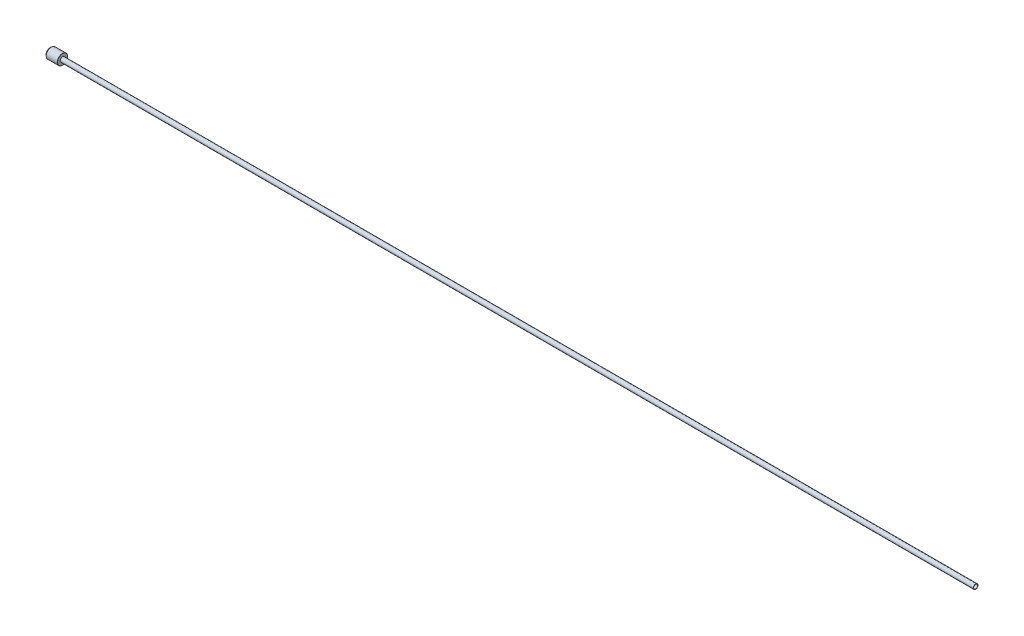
ISO-10303-21;
HEADER;
FILE_DESCRIPTION(('STEP AP214'),'2;1');
FILE_NAME('part.step','',(''),(''),'','','');
FILE_SCHEMA(('AUTOMOTIVE_DESIGN { 1 0 10303 214 1 1 1 1 }'));
ENDSEC;
DATA;
#1=APPLICATION_CONTEXT('core data for automotive mechanical design processes');
#2=APPLICATION_PROTOCOL_DEFINITION('international standard','automotive_design',2000,#1);
#3=PRODUCT_CONTEXT('',#1,'mechanical');
#4=PRODUCT('Part','Part','',(#3));
#5=PRODUCT_RELATED_PRODUCT_CATEGORY('part','',(#4));
#6=PRODUCT_DEFINITION_FORMATION('','',#4);
#7=PRODUCT_DEFINITION_CONTEXT('part definition',#1,'design');
#8=PRODUCT_DEFINITION('design','',#6,#7);
#9=PRODUCT_DEFINITION_SHAPE('','',#8);
#10=(LENGTH_UNIT() NAMED_UNIT(*) SI_UNIT(.MILLI.,.METRE.));
#11=(NAMED_UNIT(*) PLANE_ANGLE_UNIT() SI_UNIT($,.RADIAN.));
#12=(NAMED_UNIT(*) SI_UNIT($,.STERADIAN.) SOLID_ANGLE_UNIT());
#13=UNCERTAINTY_MEASURE_WITH_UNIT(LENGTH_MEASURE(1.E-05),#10,'distance_accuracy_value','');
#14=(GEOMETRIC_REPRESENTATION_CONTEXT(3) GLOBAL_UNCERTAINTY_ASSIGNED_CONTEXT((#13)) GLOBAL_UNIT_ASSIGNED_CONTEXT((#10,
#11,#12)) REPRESENTATION_CONTEXT('',''));
#15=CARTESIAN_POINT('',(0.,0.,0.));
#16=DIRECTION('',(0.,0.,1.));
#17=DIRECTION('',(1.,0.,0.));
#18=AXIS2_PLACEMENT_3D('',#15,#16,#17);
#19=CARTESIAN_POINT('',(6.,2.5,0.));
#20=DIRECTION('',(-1.,0.,0.));
#21=DIRECTION('',(0.,0.,1.));
#22=AXIS2_PLACEMENT_3D('',#19,#20,#21);
#23=PLANE('',#22);
#24=CARTESIAN_POINT('',(6.,0.,0.));
#25=DIRECTION('',(-1.,0.,0.));
#26=DIRECTION('',(0.,0.,1.));
#27=AXIS2_PLACEMENT_3D('',#24,#25,#26);
#28=CIRCLE('',#27,2.4);
#29=CARTESIAN_POINT('',(6.,0.,2.4));
#30=VERTEX_POINT('',#29);
#31=EDGE_CURVE('E10',#30,#30,#28,.F.);
#32=ORIENTED_EDGE('',*,*,#31,.T.);
#33=EDGE_LOOP('',(#32));
#34=FACE_BOUND('',#33,.T.);
#35=CARTESIAN_POINT('',(6.,0.,0.));
#36=DIRECTION('',(-1.,0.,0.));
#37=DIRECTION('',(0.,0.,1.));
#38=AXIS2_PLACEMENT_3D('',#35,#36,#37);
#39=CIRCLE('',#38,1.143);
#40=CARTESIAN_POINT('',(6.,0.,1.143));
#41=VERTEX_POINT('',#40);
#42=EDGE_CURVE('E62',#41,#41,#39,.T.);
#43=ORIENTED_EDGE('',*,*,#42,.T.);
#44=EDGE_LOOP('',(#43));
#45=FACE_BOUND('',#44,.T.);
#46=ADVANCED_FACE('F30',(#34,#45),#23,.F.);
#47=CARTESIAN_POINT('',(-22.2121854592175,0.,0.));
#48=DIRECTION('',(-1.,0.,0.));
#49=DIRECTION('',(0.,0.,1.));
#50=AXIS2_PLACEMENT_3D('',#47,#48,#49);
#51=CYLINDRICAL_SURFACE('',#50,2.5);
#52=CARTESIAN_POINT('',(5.9,0.,0.));
#53=DIRECTION('',(-1.,0.,0.));
#54=DIRECTION('',(0.,0.,1.));
#55=AXIS2_PLACEMENT_3D('',#52,#53,#54);
#56=CIRCLE('',#55,2.5);
#57=CARTESIAN_POINT('',(5.9,0.,2.5));
#58=VERTEX_POINT('',#57);
#59=EDGE_CURVE('E37',#58,#58,#56,.T.);
#60=ORIENTED_EDGE('',*,*,#59,.T.);
#61=EDGE_LOOP('',(#60));
#62=FACE_BOUND('',#61,.T.);
#63=CARTESIAN_POINT('',(0.549999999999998,0.,0.));
#64=DIRECTION('',(-1.,0.,0.));
#65=DIRECTION('',(0.,0.,1.));
#66=AXIS2_PLACEMENT_3D('',#63,#64,#65);
#67=CIRCLE('',#66,2.5);
#68=CARTESIAN_POINT('',(0.549999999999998,0.,2.5));
#69=VERTEX_POINT('',#68);
#70=EDGE_CURVE('E41',#69,#69,#67,.T.);
#71=ORIENTED_EDGE('',*,*,#70,.F.);
#72=EDGE_LOOP('',(#71));
#73=FACE_BOUND('',#72,.T.);
#74=ADVANCED_FACE('F100',(#62,#73),#51,.T.);
#75=CARTESIAN_POINT('',(0.549999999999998,0.,0.));
#76=DIRECTION('',(1.,0.,0.));
#77=DIRECTION('',(0.,0.,-1.));
#78=AXIS2_PLACEMENT_3D('',#75,#76,#77);
#79=CONICAL_SURFACE('',#78,2.5,0.78539816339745);
#80=CARTESIAN_POINT('',(0.0999999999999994,0.,0.));
#81=DIRECTION('',(-1.,0.,0.));
#82=DIRECTION('',(0.,0.,1.));
#83=AXIS2_PLACEMENT_3D('',#80,#81,#82);
#84=CIRCLE('',#83,2.05);
#85=CARTESIAN_POINT('',(0.0999999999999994,0.,2.05));
#86=VERTEX_POINT('',#85);
#87=EDGE_CURVE('E45',#86,#86,#84,.T.);
#88=ORIENTED_EDGE('',*,*,#87,.F.);
#89=EDGE_LOOP('',(#88));
#90=FACE_BOUND('',#89,.T.);
#91=ORIENTED_EDGE('',*,*,#70,.T.);
#92=EDGE_LOOP('',(#91));
#93=FACE_BOUND('',#92,.T.);
#94=ADVANCED_FACE('F94',(#90,#93),#79,.T.);
#95=CARTESIAN_POINT('',(-22.2121854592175,0.,0.));
#96=DIRECTION('',(-1.,0.,0.));
#97=DIRECTION('',(0.,0.,1.));
#98=AXIS2_PLACEMENT_3D('',#95,#96,#97);
#99=CYLINDRICAL_SURFACE('',#98,2.05);
#100=CARTESIAN_POINT('',(0.,0.,0.));
#101=DIRECTION('',(-1.,0.,0.));
#102=DIRECTION('',(0.,0.,1.));
#103=AXIS2_PLACEMENT_3D('',#100,#101,#102);
#104=CIRCLE('',#103,2.05);
#105=CARTESIAN_POINT('',(0.,0.,2.05));
#106=VERTEX_POINT('',#105);
#107=EDGE_CURVE('E50',#106,#106,#104,.T.);
#108=ORIENTED_EDGE('',*,*,#107,.F.);
#109=EDGE_LOOP('',(#108));
#110=FACE_BOUND('',#109,.T.);
#111=ORIENTED_EDGE('',*,*,#87,.T.);
#112=EDGE_LOOP('',(#111));
#113=FACE_BOUND('',#112,.T.);
#114=ADVANCED_FACE('F88',(#110,#113),#99,.T.);
#115=CARTESIAN_POINT('',(0.,0.965199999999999,0.));
#116=DIRECTION('',(1.,0.,0.));
#117=DIRECTION('',(0.,0.,-1.));
#118=AXIS2_PLACEMENT_3D('',#115,#116,#117);
#119=PLANE('',#118);
#120=CARTESIAN_POINT('',(0.,0.,0.));
#121=DIRECTION('',(-1.,0.,0.));
#122=DIRECTION('',(0.,0.,1.));
#123=AXIS2_PLACEMENT_3D('',#120,#121,#122);
#124=CIRCLE('',#123,0.965199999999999);
#125=CARTESIAN_POINT('',(0.,0.,0.965199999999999));
#126=VERTEX_POINT('',#125);
#127=EDGE_CURVE('E53',#126,#126,#124,.T.);
#128=ORIENTED_EDGE('',*,*,#127,.F.);
#129=EDGE_LOOP('',(#128));
#130=FACE_BOUND('',#129,.T.);
#131=ORIENTED_EDGE('',*,*,#107,.T.);
#132=EDGE_LOOP('',(#131));
#133=FACE_BOUND('',#132,.T.);
#134=ADVANCED_FACE('F82',(#130,#133),#119,.F.);
#135=CARTESIAN_POINT('',(-22.2121854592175,0.,0.));
#136=DIRECTION('',(-1.,0.,0.));
#137=DIRECTION('',(0.,0.,1.));
#138=AXIS2_PLACEMENT_3D('',#135,#136,#137);
#139=CYLINDRICAL_SURFACE('',#138,0.965200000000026);
#140=CARTESIAN_POINT('',(450.,0.,0.));
#141=DIRECTION('',(-1.,0.,0.));
#142=DIRECTION('',(0.,0.,1.));
#143=AXIS2_PLACEMENT_3D('',#140,#141,#142);
#144=CIRCLE('',#143,0.965200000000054);
#145=CARTESIAN_POINT('',(450.,0.,0.965200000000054));
#146=VERTEX_POINT('',#145);
#147=EDGE_CURVE('E56',#146,#146,#144,.T.);
#148=ORIENTED_EDGE('',*,*,#147,.F.);
#149=EDGE_LOOP('',(#148));
#150=FACE_BOUND('',#149,.T.);
#151=ORIENTED_EDGE('',*,*,#127,.T.);
#152=EDGE_LOOP('',(#151));
#153=FACE_BOUND('',#152,.T.);
#154=ADVANCED_FACE('F76',(#150,#153),#139,.F.);
#155=CARTESIAN_POINT('',(450.,1.143,0.));
#156=DIRECTION('',(-1.,0.,0.));
#157=DIRECTION('',(0.,0.,1.));
#158=AXIS2_PLACEMENT_3D('',#155,#156,#157);
#159=PLANE('',#158);
#160=CARTESIAN_POINT('',(450.,0.,0.));
#161=DIRECTION('',(-1.,0.,0.));
#162=DIRECTION('',(0.,0.,1.));
#163=AXIS2_PLACEMENT_3D('',#160,#161,#162);
#164=CIRCLE('',#163,1.143);
#165=CARTESIAN_POINT('',(450.,0.,1.143));
#166=VERTEX_POINT('',#165);
#167=EDGE_CURVE('E59',#166,#166,#164,.T.);
#168=ORIENTED_EDGE('',*,*,#167,.F.);
#169=EDGE_LOOP('',(#168));
#170=FACE_BOUND('',#169,.T.);
#171=ORIENTED_EDGE('',*,*,#147,.T.);
#172=EDGE_LOOP('',(#171));
#173=FACE_BOUND('',#172,.T.);
#174=ADVANCED_FACE('F70',(#170,#173),#159,.F.);
#175=CARTESIAN_POINT('',(-22.2121854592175,0.,0.));
#176=DIRECTION('',(-1.,0.,0.));
#177=DIRECTION('',(0.,0.,1.));
#178=AXIS2_PLACEMENT_3D('',#175,#176,#177);
#179=CYLINDRICAL_SURFACE('',#178,1.143);
#180=ORIENTED_EDGE('',*,*,#42,.F.);
#181=EDGE_LOOP('',(#180));
#182=FACE_BOUND('',#181,.T.);
#183=ORIENTED_EDGE('',*,*,#167,.T.);
#184=EDGE_LOOP('',(#183));
#185=FACE_BOUND('',#184,.T.);
#186=ADVANCED_FACE('F67',(#182,#185),#179,.T.);
#187=CARTESIAN_POINT('',(5.9,0.,0.));
#188=DIRECTION('',(-1.,0.,0.));
#189=DIRECTION('',(0.,0.,1.));
#190=AXIS2_PLACEMENT_3D('',#187,#188,#189);
#191=TOROIDAL_SURFACE('',#190,2.4,0.1);
#192=ORIENTED_EDGE('',*,*,#31,.F.);
#193=EDGE_LOOP('',(#192));
#194=FACE_BOUND('',#193,.T.);
#195=ORIENTED_EDGE('',*,*,#59,.F.);
#196=EDGE_LOOP('',(#195));
#197=FACE_BOUND('',#196,.T.);
#198=ADVANCED_FACE('F32',(#194,#197),#191,.T.);
#199=CLOSED_SHELL('',(#46,#74,#94,#114,#134,#154,#174,#186,#198));
#200=MANIFOLD_SOLID_BREP('B2',#199);
#201=ADVANCED_BREP_SHAPE_REPRESENTATION('',(#18,#200),#14);
#202=SHAPE_DEFINITION_REPRESENTATION(#9,#201);
ENDSEC;
END-ISO-10303-21;
